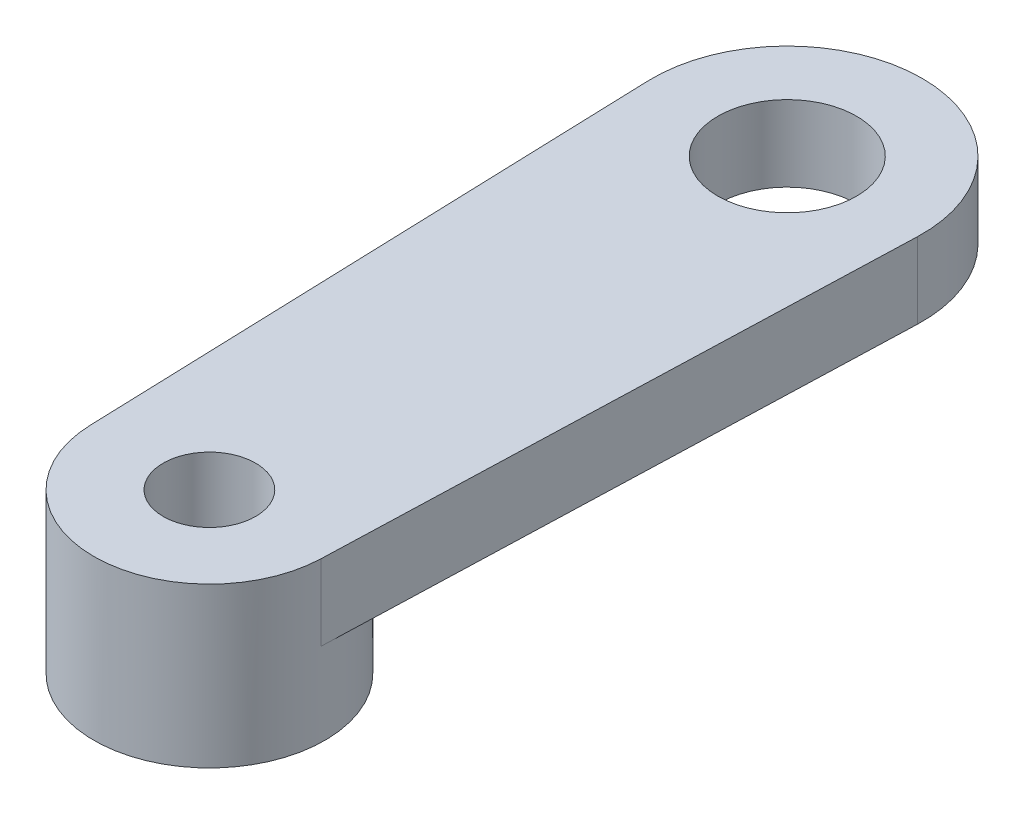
ISO-10303-21;
HEADER;
FILE_DESCRIPTION(('STEP AP214'),'2;1');
FILE_NAME('part.step','',(''),(''),'','','');
FILE_SCHEMA(('AUTOMOTIVE_DESIGN { 1 0 10303 214 1 1 1 1 }'));
ENDSEC;
DATA;
#1=APPLICATION_CONTEXT('core data for automotive mechanical design processes');
#2=APPLICATION_PROTOCOL_DEFINITION('international standard','automotive_design',2000,#1);
#3=PRODUCT_CONTEXT('',#1,'mechanical');
#4=PRODUCT('Part','Part','',(#3));
#5=PRODUCT_RELATED_PRODUCT_CATEGORY('part','',(#4));
#6=PRODUCT_DEFINITION_FORMATION('','',#4);
#7=PRODUCT_DEFINITION_CONTEXT('part definition',#1,'design');
#8=PRODUCT_DEFINITION('design','',#6,#7);
#9=PRODUCT_DEFINITION_SHAPE('','',#8);
#10=(LENGTH_UNIT() NAMED_UNIT(*) SI_UNIT(.MILLI.,.METRE.));
#11=(NAMED_UNIT(*) PLANE_ANGLE_UNIT() SI_UNIT($,.RADIAN.));
#12=(NAMED_UNIT(*) SI_UNIT($,.STERADIAN.) SOLID_ANGLE_UNIT());
#13=UNCERTAINTY_MEASURE_WITH_UNIT(LENGTH_MEASURE(1.E-05),#10,'distance_accuracy_value','');
#14=(GEOMETRIC_REPRESENTATION_CONTEXT(3) GLOBAL_UNCERTAINTY_ASSIGNED_CONTEXT((#13)) GLOBAL_UNIT_ASSIGNED_CONTEXT((#10,
#11,#12)) REPRESENTATION_CONTEXT('',''));
#15=CARTESIAN_POINT('',(0.,0.,0.));
#16=DIRECTION('',(0.,0.,1.));
#17=DIRECTION('',(1.,0.,0.));
#18=AXIS2_PLACEMENT_3D('',#15,#16,#17);
#19=CARTESIAN_POINT('',(0.,0.,0.));
#20=DIRECTION('',(0.,-1.,0.));
#21=DIRECTION('',(0.,0.,-1.));
#22=AXIS2_PLACEMENT_3D('',#19,#20,#21);
#23=PLANE('',#22);
#24=CARTESIAN_POINT('',(0.,0.,0.));
#25=DIRECTION('',(0.,1.,0.));
#26=DIRECTION('',(0.,0.,1.));
#27=AXIS2_PLACEMENT_3D('',#24,#25,#26);
#28=CIRCLE('',#27,1.524);
#29=CARTESIAN_POINT('',(0.,0.,1.524));
#30=VERTEX_POINT('',#29);
#31=EDGE_CURVE('E139',#30,#30,#28,.T.);
#32=ORIENTED_EDGE('',*,*,#31,.T.);
#33=EDGE_LOOP('',(#32));
#34=FACE_BOUND('',#33,.T.);
#35=CARTESIAN_POINT('',(0.,0.,0.));
#36=DIRECTION('',(0.,-1.,0.));
#37=DIRECTION('',(0.,0.,-1.));
#38=AXIS2_PLACEMENT_3D('',#35,#36,#37);
#39=CIRCLE('',#38,2.44856);
#40=CARTESIAN_POINT('',(0.,0.,-2.44856));
#41=VERTEX_POINT('',#40);
#42=EDGE_CURVE('E151',#41,#41,#39,.T.);
#43=ORIENTED_EDGE('',*,*,#42,.T.);
#44=EDGE_LOOP('',(#43));
#45=FACE_BOUND('',#44,.T.);
#46=ADVANCED_FACE('F41',(#34,#45),#23,.T.);
#47=CARTESIAN_POINT('',(0.,2.5,0.));
#48=DIRECTION('',(0.,-1.,0.));
#49=DIRECTION('',(0.,0.,-1.));
#50=AXIS2_PLACEMENT_3D('',#47,#48,#49);
#51=PLANE('',#50);
#52=CARTESIAN_POINT('',(0.,2.5,0.));
#53=DIRECTION('',(0.,1.,0.));
#54=DIRECTION('',(0.,0.,-1.));
#55=AXIS2_PLACEMENT_3D('',#52,#53,#54);
#56=CIRCLE('',#55,3.81);
#57=CARTESIAN_POINT('',(-3.80786609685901,2.5,0.127498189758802));
#58=VERTEX_POINT('',#57);
#59=CARTESIAN_POINT('',(3.80786609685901,2.5,0.127498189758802));
#60=VERTEX_POINT('',#59);
#61=EDGE_CURVE('E106',#58,#60,#56,.T.);
#62=ORIENTED_EDGE('',*,*,#61,.T.);
#63=DIRECTION('',(0.0334640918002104,0.,-0.999439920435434));
#64=VECTOR('',#63,1.);
#65=CARTESIAN_POINT('',(4.445,2.5,-18.9011687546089));
#66=LINE('',#65,#64);
#67=CARTESIAN_POINT('',(4.445,2.5,-18.9011687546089));
#68=VERTEX_POINT('',#67);
#69=EDGE_CURVE('E89',#60,#68,#66,.T.);
#70=ORIENTED_EDGE('',*,*,#69,.T.);
#71=CARTESIAN_POINT('',(0.,2.5,-19.05));
#72=DIRECTION('',(0.,1.,0.));
#73=DIRECTION('',(0.,0.,-1.));
#74=AXIS2_PLACEMENT_3D('',#71,#72,#73);
#75=CIRCLE('',#74,4.44749094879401);
#76=CARTESIAN_POINT('',(-4.445,2.5,-18.9011687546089));
#77=VERTEX_POINT('',#76);
#78=EDGE_CURVE('E114',#68,#77,#75,.T.);
#79=ORIENTED_EDGE('',*,*,#78,.T.);
#80=DIRECTION('',(0.0334640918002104,0.,0.999439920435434));
#81=VECTOR('',#80,1.);
#82=CARTESIAN_POINT('',(-3.80786609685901,2.5,0.127498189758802));
#83=LINE('',#82,#81);
#84=EDGE_CURVE('E60',#77,#58,#83,.T.);
#85=ORIENTED_EDGE('',*,*,#84,.T.);
#86=EDGE_LOOP('',(#62,#70,#79,#85));
#87=FACE_BOUND('',#86,.T.);
#88=CARTESIAN_POINT('',(0.,2.5,-19.05));
#89=DIRECTION('',(0.,1.,0.));
#90=DIRECTION('',(0.,0.,1.));
#91=AXIS2_PLACEMENT_3D('',#88,#89,#90);
#92=CIRCLE('',#91,2.286);
#93=CARTESIAN_POINT('',(0.,2.5,-16.764));
#94=VERTEX_POINT('',#93);
#95=EDGE_CURVE('E101',#94,#94,#92,.T.);
#96=ORIENTED_EDGE('',*,*,#95,.F.);
#97=EDGE_LOOP('',(#96));
#98=FACE_BOUND('',#97,.T.);
#99=CARTESIAN_POINT('',(0.,2.5,0.));
#100=DIRECTION('',(0.,1.,0.));
#101=DIRECTION('',(0.,0.,1.));
#102=AXIS2_PLACEMENT_3D('',#99,#100,#101);
#103=CIRCLE('',#102,1.524);
#104=CARTESIAN_POINT('',(0.,2.5,1.524));
#105=VERTEX_POINT('',#104);
#106=EDGE_CURVE('E135',#105,#105,#103,.T.);
#107=ORIENTED_EDGE('',*,*,#106,.F.);
#108=EDGE_LOOP('',(#107));
#109=FACE_BOUND('',#108,.T.);
#110=ADVANCED_FACE('F176',(#87,#98,#109),#51,.F.);
#111=CARTESIAN_POINT('',(0.,0.,0.));
#112=DIRECTION('',(0.,-1.,0.));
#113=DIRECTION('',(0.,0.,-1.));
#114=AXIS2_PLACEMENT_3D('',#111,#112,#113);
#115=CIRCLE('',#114,3.81);
#116=CARTESIAN_POINT('',(-3.80786609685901,0.,0.127498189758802));
#117=VERTEX_POINT('',#116);
#118=CARTESIAN_POINT('',(3.80786609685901,0.,0.127498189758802));
#119=VERTEX_POINT('',#118);
#120=EDGE_CURVE('E11',#117,#119,#115,.T.);
#121=ORIENTED_EDGE('',*,*,#120,.F.);
#122=DIRECTION('',(0.0334640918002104,0.,0.999439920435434));
#123=VECTOR('',#122,1.);
#124=CARTESIAN_POINT('',(-3.80786609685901,0.,0.127498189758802));
#125=LINE('',#124,#123);
#126=CARTESIAN_POINT('',(-4.445,0.,-18.9011687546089));
#127=VERTEX_POINT('',#126);
#128=EDGE_CURVE('E117',#127,#117,#125,.T.);
#129=ORIENTED_EDGE('',*,*,#128,.F.);
#130=CARTESIAN_POINT('',(0.,0.,-19.05));
#131=DIRECTION('',(0.,1.,0.));
#132=DIRECTION('',(0.,0.,-1.));
#133=AXIS2_PLACEMENT_3D('',#130,#131,#132);
#134=CIRCLE('',#133,4.44749094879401);
#135=CARTESIAN_POINT('',(4.445,0.,-18.9011687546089));
#136=VERTEX_POINT('',#135);
#137=EDGE_CURVE('E75',#136,#127,#134,.T.);
#138=ORIENTED_EDGE('',*,*,#137,.F.);
#139=DIRECTION('',(0.0334640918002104,0.,-0.999439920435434));
#140=VECTOR('',#139,1.);
#141=CARTESIAN_POINT('',(4.445,0.,-18.9011687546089));
#142=LINE('',#141,#140);
#143=EDGE_CURVE('E93',#119,#136,#142,.T.);
#144=ORIENTED_EDGE('',*,*,#143,.F.);
#145=EDGE_LOOP('',(#121,#129,#138,#144));
#146=FACE_BOUND('',#145,.T.);
#147=CARTESIAN_POINT('',(0.,0.,-19.05));
#148=DIRECTION('',(0.,1.,0.));
#149=DIRECTION('',(0.,0.,1.));
#150=AXIS2_PLACEMENT_3D('',#147,#148,#149);
#151=CIRCLE('',#150,2.286);
#152=CARTESIAN_POINT('',(0.,0.,-16.764));
#153=VERTEX_POINT('',#152);
#154=EDGE_CURVE('E131',#153,#153,#151,.T.);
#155=ORIENTED_EDGE('',*,*,#154,.T.);
#156=EDGE_LOOP('',(#155));
#157=FACE_BOUND('',#156,.T.);
#158=ADVANCED_FACE('F98',(#146,#157),#23,.T.);
#159=CARTESIAN_POINT('',(0.,2.5,0.));
#160=DIRECTION('',(0.,-1.,0.));
#161=DIRECTION('',(0.,0.,-1.));
#162=AXIS2_PLACEMENT_3D('',#159,#160,#161);
#163=CYLINDRICAL_SURFACE('',#162,3.81);
#164=DIRECTION('',(0.,-1.,0.));
#165=VECTOR('',#164,1.);
#166=CARTESIAN_POINT('',(-3.80786609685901,2.5,0.127498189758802));
#167=LINE('',#166,#165);
#168=EDGE_CURVE('E105',#58,#117,#167,.T.);
#169=ORIENTED_EDGE('',*,*,#168,.T.);
#170=ORIENTED_EDGE('',*,*,#120,.T.);
#171=DIRECTION('',(0.,-1.,0.));
#172=VECTOR('',#171,1.);
#173=CARTESIAN_POINT('',(3.80786609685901,2.5,0.127498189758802));
#174=LINE('',#173,#172);
#175=EDGE_CURVE('E45',#60,#119,#174,.T.);
#176=ORIENTED_EDGE('',*,*,#175,.F.);
#177=ORIENTED_EDGE('',*,*,#61,.F.);
#178=EDGE_LOOP('',(#169,#170,#176,#177));
#179=FACE_BOUND('',#178,.T.);
#180=CARTESIAN_POINT('',(0.,-2.75,0.));
#181=DIRECTION('',(0.,-1.,0.));
#182=DIRECTION('',(0.,0.,-1.));
#183=AXIS2_PLACEMENT_3D('',#180,#181,#182);
#184=CIRCLE('',#183,3.81);
#185=CARTESIAN_POINT('',(0.,-2.75,-3.81));
#186=VERTEX_POINT('',#185);
#187=EDGE_CURVE('E143',#186,#186,#184,.T.);
#188=ORIENTED_EDGE('',*,*,#187,.F.);
#189=EDGE_LOOP('',(#188));
#190=FACE_BOUND('',#189,.T.);
#191=ADVANCED_FACE('F43',(#179,#190),#163,.T.);
#192=CARTESIAN_POINT('',(4.445,2.5,-18.9011687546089));
#193=DIRECTION('',(-0.999439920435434,0.,-0.0334640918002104));
#194=DIRECTION('',(-0.0334640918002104,0.,0.999439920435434));
#195=AXIS2_PLACEMENT_3D('',#192,#193,#194);
#196=PLANE('',#195);
#197=ORIENTED_EDGE('',*,*,#143,.T.);
#198=DIRECTION('',(0.,-1.,0.));
#199=VECTOR('',#198,1.);
#200=CARTESIAN_POINT('',(4.445,2.5,-18.9011687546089));
#201=LINE('',#200,#199);
#202=EDGE_CURVE('E97',#68,#136,#201,.T.);
#203=ORIENTED_EDGE('',*,*,#202,.F.);
#204=ORIENTED_EDGE('',*,*,#69,.F.);
#205=ORIENTED_EDGE('',*,*,#175,.T.);
#206=EDGE_LOOP('',(#197,#203,#204,#205));
#207=FACE_BOUND('',#206,.T.);
#208=ADVANCED_FACE('F92',(#207),#196,.F.);
#209=CARTESIAN_POINT('',(0.,2.5,-19.05));
#210=DIRECTION('',(0.,-1.,0.));
#211=DIRECTION('',(0.,0.,-1.));
#212=AXIS2_PLACEMENT_3D('',#209,#210,#211);
#213=CYLINDRICAL_SURFACE('',#212,4.44749094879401);
#214=ORIENTED_EDGE('',*,*,#137,.T.);
#215=DIRECTION('',(0.,-1.,0.));
#216=VECTOR('',#215,1.);
#217=CARTESIAN_POINT('',(-4.445,2.5,-18.9011687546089));
#218=LINE('',#217,#216);
#219=EDGE_CURVE('E109',#77,#127,#218,.T.);
#220=ORIENTED_EDGE('',*,*,#219,.F.);
#221=ORIENTED_EDGE('',*,*,#78,.F.);
#222=ORIENTED_EDGE('',*,*,#202,.T.);
#223=EDGE_LOOP('',(#214,#220,#221,#222));
#224=FACE_BOUND('',#223,.T.);
#225=ADVANCED_FACE('F121',(#224),#213,.T.);
#226=CARTESIAN_POINT('',(-3.80786609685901,2.5,0.127498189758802));
#227=DIRECTION('',(0.999439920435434,0.,-0.0334640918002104));
#228=DIRECTION('',(-0.0334640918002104,0.,-0.999439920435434));
#229=AXIS2_PLACEMENT_3D('',#226,#227,#228);
#230=PLANE('',#229);
#231=ORIENTED_EDGE('',*,*,#128,.T.);
#232=ORIENTED_EDGE('',*,*,#168,.F.);
#233=ORIENTED_EDGE('',*,*,#84,.F.);
#234=ORIENTED_EDGE('',*,*,#219,.T.);
#235=EDGE_LOOP('',(#231,#232,#233,#234));
#236=FACE_BOUND('',#235,.T.);
#237=ADVANCED_FACE('F195',(#236),#230,.F.);
#238=CARTESIAN_POINT('',(0.,2.5,-19.05));
#239=DIRECTION('',(0.,-1.,0.));
#240=DIRECTION('',(0.,0.,-1.));
#241=AXIS2_PLACEMENT_3D('',#238,#239,#240);
#242=CYLINDRICAL_SURFACE('',#241,2.286);
#243=ORIENTED_EDGE('',*,*,#95,.T.);
#244=EDGE_LOOP('',(#243));
#245=FACE_BOUND('',#244,.T.);
#246=ORIENTED_EDGE('',*,*,#154,.F.);
#247=EDGE_LOOP('',(#246));
#248=FACE_BOUND('',#247,.T.);
#249=ADVANCED_FACE('F172',(#245,#248),#242,.F.);
#250=CARTESIAN_POINT('',(0.,2.5,0.));
#251=DIRECTION('',(0.,-1.,0.));
#252=DIRECTION('',(0.,0.,-1.));
#253=AXIS2_PLACEMENT_3D('',#250,#251,#252);
#254=CYLINDRICAL_SURFACE('',#253,1.524);
#255=ORIENTED_EDGE('',*,*,#106,.T.);
#256=EDGE_LOOP('',(#255));
#257=FACE_BOUND('',#256,.T.);
#258=ORIENTED_EDGE('',*,*,#31,.F.);
#259=EDGE_LOOP('',(#258));
#260=FACE_BOUND('',#259,.T.);
#261=ADVANCED_FACE('F164',(#257,#260),#254,.F.);
#262=CARTESIAN_POINT('',(0.,-2.75,0.));
#263=DIRECTION('',(0.,-1.,0.));
#264=DIRECTION('',(0.,0.,-1.));
#265=AXIS2_PLACEMENT_3D('',#262,#263,#264);
#266=PLANE('',#265);
#267=ORIENTED_EDGE('',*,*,#187,.T.);
#268=EDGE_LOOP('',(#267));
#269=FACE_BOUND('',#268,.T.);
#270=CARTESIAN_POINT('',(0.,-2.75,0.));
#271=DIRECTION('',(0.,-1.,0.));
#272=DIRECTION('',(0.,0.,-1.));
#273=AXIS2_PLACEMENT_3D('',#270,#271,#272);
#274=CIRCLE('',#273,2.44856);
#275=CARTESIAN_POINT('',(0.,-2.75,-2.44856));
#276=VERTEX_POINT('',#275);
#277=EDGE_CURVE('E150',#276,#276,#274,.T.);
#278=ORIENTED_EDGE('',*,*,#277,.F.);
#279=EDGE_LOOP('',(#278));
#280=FACE_BOUND('',#279,.T.);
#281=ADVANCED_FACE('F162',(#269,#280),#266,.T.);
#282=CARTESIAN_POINT('',(0.,-2.75,0.));
#283=DIRECTION('',(0.,1.,0.));
#284=DIRECTION('',(0.,0.,1.));
#285=AXIS2_PLACEMENT_3D('',#282,#283,#284);
#286=CYLINDRICAL_SURFACE('',#285,2.44856);
#287=ORIENTED_EDGE('',*,*,#277,.T.);
#288=EDGE_LOOP('',(#287));
#289=FACE_BOUND('',#288,.T.);
#290=ORIENTED_EDGE('',*,*,#42,.F.);
#291=EDGE_LOOP('',(#290));
#292=FACE_BOUND('',#291,.T.);
#293=ADVANCED_FACE('F159',(#289,#292),#286,.F.);
#294=CLOSED_SHELL('',(#46,#110,#158,#191,#208,#225,#237,#249,#261,#281,#293));
#295=MANIFOLD_SOLID_BREP('B2',#294);
#296=ADVANCED_BREP_SHAPE_REPRESENTATION('',(#18,#295),#14);
#297=SHAPE_DEFINITION_REPRESENTATION(#9,#296);
ENDSEC;
END-ISO-10303-21;
